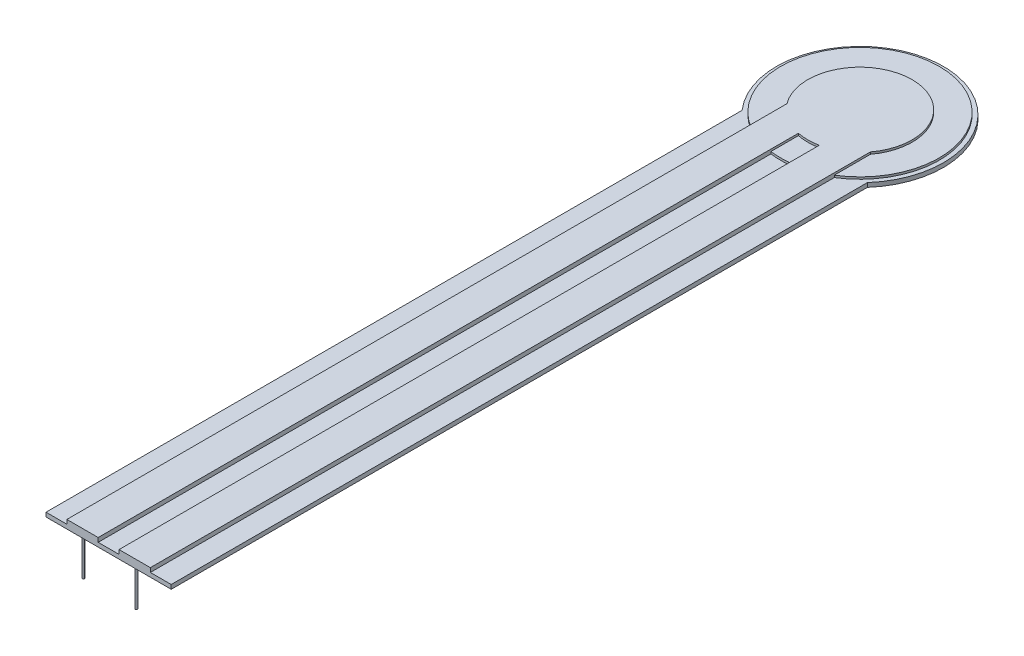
ISO-10303-21;
HEADER;
FILE_DESCRIPTION(('STEP AP214'),'2;1');
FILE_NAME('part.step','',(''),(''),'','','');
FILE_SCHEMA(('AUTOMOTIVE_DESIGN { 1 0 10303 214 1 1 1 1 }'));
ENDSEC;
DATA;
#1=APPLICATION_CONTEXT('core data for automotive mechanical design processes');
#2=APPLICATION_PROTOCOL_DEFINITION('international standard','automotive_design',2000,#1);
#3=PRODUCT_CONTEXT('',#1,'mechanical');
#4=PRODUCT('Part','Part','',(#3));
#5=PRODUCT_RELATED_PRODUCT_CATEGORY('part','',(#4));
#6=PRODUCT_DEFINITION_FORMATION('','',#4);
#7=PRODUCT_DEFINITION_CONTEXT('part definition',#1,'design');
#8=PRODUCT_DEFINITION('design','',#6,#7);
#9=PRODUCT_DEFINITION_SHAPE('','',#8);
#10=(LENGTH_UNIT() NAMED_UNIT(*) SI_UNIT(.MILLI.,.METRE.));
#11=(NAMED_UNIT(*) PLANE_ANGLE_UNIT() SI_UNIT($,.RADIAN.));
#12=(NAMED_UNIT(*) SI_UNIT($,.STERADIAN.) SOLID_ANGLE_UNIT());
#13=UNCERTAINTY_MEASURE_WITH_UNIT(LENGTH_MEASURE(1.E-05),#10,'distance_accuracy_value','');
#14=(GEOMETRIC_REPRESENTATION_CONTEXT(3) GLOBAL_UNCERTAINTY_ASSIGNED_CONTEXT((#13)) GLOBAL_UNIT_ASSIGNED_CONTEXT((#10,
#11,#12)) REPRESENTATION_CONTEXT('',''));
#15=CARTESIAN_POINT('',(0.,0.,0.));
#16=DIRECTION('',(0.,0.,1.));
#17=DIRECTION('',(1.,0.,0.));
#18=AXIS2_PLACEMENT_3D('',#15,#16,#17);
#19=CARTESIAN_POINT('',(0.,0.,-36.));
#20=DIRECTION('',(0.,1.,0.));
#21=DIRECTION('',(0.,0.,1.));
#22=AXIS2_PLACEMENT_3D('',#19,#20,#21);
#23=PLANE('',#22);
#24=CARTESIAN_POINT('',(1.27,0.,-0.057768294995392));
#25=DIRECTION('',(0.,1.,0.));
#26=DIRECTION('',(0.,0.,1.));
#27=AXIS2_PLACEMENT_3D('',#24,#25,#26);
#28=CIRCLE('',#27,0.0499999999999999);
#29=CARTESIAN_POINT('',(1.27,0.,-0.00776829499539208));
#30=VERTEX_POINT('',#29);
#31=EDGE_CURVE('E41',#30,#30,#28,.F.);
#32=ORIENTED_EDGE('',*,*,#31,.F.);
#33=EDGE_LOOP('',(#32));
#34=FACE_BOUND('',#33,.T.);
#35=CARTESIAN_POINT('',(0.,0.,-36.));
#36=DIRECTION('',(0.,1.,0.));
#37=DIRECTION('',(0.,0.,1.));
#38=AXIS2_PLACEMENT_3D('',#35,#36,#37);
#39=CIRCLE('',#38,4.);
#40=CARTESIAN_POINT('',(3.,0.,-33.3542486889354));
#41=VERTEX_POINT('',#40);
#42=CARTESIAN_POINT('',(-3.,0.,-33.3542486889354));
#43=VERTEX_POINT('',#42);
#44=EDGE_CURVE('E194',#41,#43,#39,.T.);
#45=ORIENTED_EDGE('',*,*,#44,.F.);
#46=DIRECTION('',(0.,0.,-1.));
#47=VECTOR('',#46,1.);
#48=CARTESIAN_POINT('',(3.,0.,0.));
#49=LINE('',#48,#47);
#50=CARTESIAN_POINT('',(3.,0.,0.));
#51=VERTEX_POINT('',#50);
#52=EDGE_CURVE('E186',#51,#41,#49,.T.);
#53=ORIENTED_EDGE('',*,*,#52,.F.);
#54=DIRECTION('',(1.,0.,0.));
#55=VECTOR('',#54,1.);
#56=CARTESIAN_POINT('',(-2.99999999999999,0.,0.));
#57=LINE('',#56,#55);
#58=CARTESIAN_POINT('',(-2.99999999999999,0.,0.));
#59=VERTEX_POINT('',#58);
#60=EDGE_CURVE('E190',#59,#51,#57,.T.);
#61=ORIENTED_EDGE('',*,*,#60,.F.);
#62=DIRECTION('',(0.,0.,1.));
#63=VECTOR('',#62,1.);
#64=CARTESIAN_POINT('',(-2.99999999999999,0.,0.));
#65=LINE('',#64,#63);
#66=EDGE_CURVE('E192',#43,#59,#65,.T.);
#67=ORIENTED_EDGE('',*,*,#66,.F.);
#68=EDGE_LOOP('',(#45,#53,#61,#67));
#69=FACE_BOUND('',#68,.T.);
#70=CARTESIAN_POINT('',(-1.27,0.,-0.057768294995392));
#71=DIRECTION('',(0.,1.,0.));
#72=DIRECTION('',(0.,0.,1.));
#73=AXIS2_PLACEMENT_3D('',#70,#71,#72);
#74=CIRCLE('',#73,0.0499999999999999);
#75=CARTESIAN_POINT('',(-1.27,0.,-0.00776829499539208));
#76=VERTEX_POINT('',#75);
#77=EDGE_CURVE('E11',#76,#76,#74,.F.);
#78=ORIENTED_EDGE('',*,*,#77,.F.);
#79=EDGE_LOOP('',(#78));
#80=FACE_BOUND('',#79,.T.);
#81=ADVANCED_FACE('F33',(#34,#69,#80),#23,.F.);
#82=CARTESIAN_POINT('',(0.,0.2,-36.));
#83=DIRECTION('',(0.,1.,0.));
#84=DIRECTION('',(0.,0.,1.));
#85=AXIS2_PLACEMENT_3D('',#82,#83,#84);
#86=PLANE('',#85);
#87=DIRECTION('',(1.,0.,0.));
#88=VECTOR('',#87,1.);
#89=CARTESIAN_POINT('',(-2.99999999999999,0.2,0.));
#90=LINE('',#89,#88);
#91=CARTESIAN_POINT('',(-2.99999999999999,0.2,0.));
#92=VERTEX_POINT('',#91);
#93=CARTESIAN_POINT('',(-2.,0.2,0.));
#94=VERTEX_POINT('',#93);
#95=EDGE_CURVE('E165',#92,#94,#90,.T.);
#96=ORIENTED_EDGE('',*,*,#95,.T.);
#97=DIRECTION('',(0.,0.,1.));
#98=VECTOR('',#97,1.);
#99=CARTESIAN_POINT('',(-2.,0.2,0.));
#100=LINE('',#99,#98);
#101=CARTESIAN_POINT('',(-2.,0.2,-32.7689011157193));
#102=VERTEX_POINT('',#101);
#103=EDGE_CURVE('E148',#102,#94,#100,.T.);
#104=ORIENTED_EDGE('',*,*,#103,.F.);
#105=CARTESIAN_POINT('',(0.,0.2,-36.));
#106=DIRECTION('',(0.,1.,0.));
#107=DIRECTION('',(0.,0.,1.));
#108=AXIS2_PLACEMENT_3D('',#105,#106,#107);
#109=CIRCLE('',#108,3.8);
#110=CARTESIAN_POINT('',(2.,0.2,-32.7689011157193));
#111=VERTEX_POINT('',#110);
#112=EDGE_CURVE('E201',#111,#102,#109,.T.);
#113=ORIENTED_EDGE('',*,*,#112,.F.);
#114=DIRECTION('',(0.,0.,-1.));
#115=VECTOR('',#114,1.);
#116=CARTESIAN_POINT('',(2.,0.2,0.));
#117=LINE('',#116,#115);
#118=CARTESIAN_POINT('',(2.,0.2,0.));
#119=VERTEX_POINT('',#118);
#120=EDGE_CURVE('E242',#119,#111,#117,.T.);
#121=ORIENTED_EDGE('',*,*,#120,.F.);
#122=CARTESIAN_POINT('',(3.,0.2,0.));
#123=VERTEX_POINT('',#122);
#124=EDGE_CURVE('E177',#119,#123,#90,.T.);
#125=ORIENTED_EDGE('',*,*,#124,.T.);
#126=DIRECTION('',(0.,0.,-1.));
#127=VECTOR('',#126,1.);
#128=CARTESIAN_POINT('',(3.,0.2,0.));
#129=LINE('',#128,#127);
#130=CARTESIAN_POINT('',(3.,0.2,-33.3542486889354));
#131=VERTEX_POINT('',#130);
#132=EDGE_CURVE('E56',#123,#131,#129,.T.);
#133=ORIENTED_EDGE('',*,*,#132,.T.);
#134=CARTESIAN_POINT('',(0.,0.2,-36.));
#135=DIRECTION('',(0.,1.,0.));
#136=DIRECTION('',(0.,0.,1.));
#137=AXIS2_PLACEMENT_3D('',#134,#135,#136);
#138=CIRCLE('',#137,4.);
#139=CARTESIAN_POINT('',(-3.,0.2,-33.3542486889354));
#140=VERTEX_POINT('',#139);
#141=EDGE_CURVE('E185',#131,#140,#138,.T.);
#142=ORIENTED_EDGE('',*,*,#141,.T.);
#143=DIRECTION('',(0.,0.,1.));
#144=VECTOR('',#143,1.);
#145=CARTESIAN_POINT('',(-2.99999999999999,0.2,0.));
#146=LINE('',#145,#144);
#147=EDGE_CURVE('E173',#140,#92,#146,.T.);
#148=ORIENTED_EDGE('',*,*,#147,.T.);
#149=EDGE_LOOP('',(#96,#104,#113,#121,#125,#133,#142,#148));
#150=FACE_BOUND('',#149,.T.);
#151=ADVANCED_FACE('F172',(#150),#86,.T.);
#152=CARTESIAN_POINT('',(-0.5,0.2,-32.2330383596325));
#153=VERTEX_POINT('',#152);
#154=CARTESIAN_POINT('',(0.5,0.2,-32.2330383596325));
#155=VERTEX_POINT('',#154);
#156=EDGE_CURVE('E202',#153,#155,#109,.T.);
#157=ORIENTED_EDGE('',*,*,#156,.F.);
#158=DIRECTION('',(0.,0.,-1.));
#159=VECTOR('',#158,1.);
#160=CARTESIAN_POINT('',(-0.5,0.2,0.));
#161=LINE('',#160,#159);
#162=CARTESIAN_POINT('',(-0.5,0.2,0.));
#163=VERTEX_POINT('',#162);
#164=EDGE_CURVE('E158',#163,#153,#161,.T.);
#165=ORIENTED_EDGE('',*,*,#164,.F.);
#166=CARTESIAN_POINT('',(0.5,0.2,0.));
#167=VERTEX_POINT('',#166);
#168=EDGE_CURVE('E175',#163,#167,#90,.T.);
#169=ORIENTED_EDGE('',*,*,#168,.T.);
#170=DIRECTION('',(0.,0.,1.));
#171=VECTOR('',#170,1.);
#172=CARTESIAN_POINT('',(0.5,0.2,0.));
#173=LINE('',#172,#171);
#174=EDGE_CURVE('E244',#155,#167,#173,.T.);
#175=ORIENTED_EDGE('',*,*,#174,.F.);
#176=EDGE_LOOP('',(#157,#165,#169,#175));
#177=FACE_BOUND('',#176,.T.);
#178=ADVANCED_FACE('F268',(#177),#86,.T.);
#179=CARTESIAN_POINT('',(0.,0.3,-36.));
#180=DIRECTION('',(0.,-1.,0.));
#181=DIRECTION('',(0.,0.,-1.));
#182=AXIS2_PLACEMENT_3D('',#179,#180,#181);
#183=CYLINDRICAL_SURFACE('',#182,3.8);
#184=DIRECTION('',(0.,-1.,0.));
#185=VECTOR('',#184,1.);
#186=CARTESIAN_POINT('',(-2.,0.3,-32.7689011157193));
#187=LINE('',#186,#185);
#188=CARTESIAN_POINT('',(-2.,0.3,-32.7689011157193));
#189=VERTEX_POINT('',#188);
#190=EDGE_CURVE('E154',#189,#102,#187,.T.);
#191=ORIENTED_EDGE('',*,*,#190,.F.);
#192=CARTESIAN_POINT('',(0.,0.3,-36.));
#193=DIRECTION('',(0.,1.,0.));
#194=DIRECTION('',(0.,0.,1.));
#195=AXIS2_PLACEMENT_3D('',#192,#193,#194);
#196=CIRCLE('',#195,3.8);
#197=CARTESIAN_POINT('',(2.,0.3,-32.7689011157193));
#198=VERTEX_POINT('',#197);
#199=EDGE_CURVE('E197',#198,#189,#196,.T.);
#200=ORIENTED_EDGE('',*,*,#199,.F.);
#201=DIRECTION('',(0.,-1.,0.));
#202=VECTOR('',#201,1.);
#203=CARTESIAN_POINT('',(2.,0.3,-32.7689011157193));
#204=LINE('',#203,#202);
#205=EDGE_CURVE('E169',#111,#198,#204,.F.);
#206=ORIENTED_EDGE('',*,*,#205,.F.);
#207=ORIENTED_EDGE('',*,*,#112,.T.);
#208=EDGE_LOOP('',(#191,#200,#206,#207));
#209=FACE_BOUND('',#208,.T.);
#210=ADVANCED_FACE('F273',(#209),#183,.T.);
#211=DIRECTION('',(0.,-1.,0.));
#212=VECTOR('',#211,1.);
#213=CARTESIAN_POINT('',(-0.5,0.3,-32.2330383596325));
#214=LINE('',#213,#212);
#215=CARTESIAN_POINT('',(-0.5,0.3,-32.2330383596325));
#216=VERTEX_POINT('',#215);
#217=EDGE_CURVE('E206',#153,#216,#214,.F.);
#218=ORIENTED_EDGE('',*,*,#217,.F.);
#219=ORIENTED_EDGE('',*,*,#156,.T.);
#220=DIRECTION('',(0.,-1.,0.));
#221=VECTOR('',#220,1.);
#222=CARTESIAN_POINT('',(0.5,0.3,-32.2330383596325));
#223=LINE('',#222,#221);
#224=CARTESIAN_POINT('',(0.5,0.3,-32.2330383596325));
#225=VERTEX_POINT('',#224);
#226=EDGE_CURVE('E208',#225,#155,#223,.T.);
#227=ORIENTED_EDGE('',*,*,#226,.F.);
#228=EDGE_CURVE('E198',#216,#225,#196,.T.);
#229=ORIENTED_EDGE('',*,*,#228,.F.);
#230=EDGE_LOOP('',(#218,#219,#227,#229));
#231=FACE_BOUND('',#230,.T.);
#232=ADVANCED_FACE('F361',(#231),#183,.T.);
#233=CARTESIAN_POINT('',(0.,0.3,-36.));
#234=DIRECTION('',(0.,1.,0.));
#235=DIRECTION('',(0.,0.,1.));
#236=AXIS2_PLACEMENT_3D('',#233,#234,#235);
#237=PLANE('',#236);
#238=CARTESIAN_POINT('',(0.,0.3,-36.));
#239=DIRECTION('',(0.,1.,0.));
#240=DIRECTION('',(0.,0.,1.));
#241=AXIS2_PLACEMENT_3D('',#238,#239,#240);
#242=CIRCLE('',#241,2.5);
#243=CARTESIAN_POINT('',(0.500000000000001,0.3,-33.5505102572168));
#244=VERTEX_POINT('',#243);
#245=CARTESIAN_POINT('',(-0.5,0.3,-33.5505102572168));
#246=VERTEX_POINT('',#245);
#247=EDGE_CURVE('E317',#244,#246,#242,.F.);
#248=ORIENTED_EDGE('',*,*,#247,.T.);
#249=DIRECTION('',(0.,0.,1.));
#250=VECTOR('',#249,1.);
#251=CARTESIAN_POINT('',(-0.5,0.3,-36.));
#252=LINE('',#251,#250);
#253=EDGE_CURVE('E320',#246,#216,#252,.T.);
#254=ORIENTED_EDGE('',*,*,#253,.T.);
#255=ORIENTED_EDGE('',*,*,#228,.T.);
#256=DIRECTION('',(0.,0.,-1.));
#257=VECTOR('',#256,1.);
#258=CARTESIAN_POINT('',(0.5,0.3,-36.));
#259=LINE('',#258,#257);
#260=EDGE_CURVE('E314',#225,#244,#259,.T.);
#261=ORIENTED_EDGE('',*,*,#260,.T.);
#262=EDGE_LOOP('',(#248,#254,#255,#261));
#263=FACE_BOUND('',#262,.T.);
#264=ADVANCED_FACE('F359',(#263),#237,.T.);
#265=ORIENTED_EDGE('',*,*,#199,.T.);
#266=DIRECTION('',(0.,0.,-1.));
#267=VECTOR('',#266,1.);
#268=CARTESIAN_POINT('',(-2.,0.3,-36.));
#269=LINE('',#268,#267);
#270=CARTESIAN_POINT('',(-2.,0.3,-34.5));
#271=VERTEX_POINT('',#270);
#272=EDGE_CURVE('E311',#189,#271,#269,.T.);
#273=ORIENTED_EDGE('',*,*,#272,.T.);
#274=CARTESIAN_POINT('',(0.,0.3,-36.));
#275=DIRECTION('',(0.,1.,0.));
#276=DIRECTION('',(0.,0.,1.));
#277=AXIS2_PLACEMENT_3D('',#274,#275,#276);
#278=CIRCLE('',#277,2.5);
#279=CARTESIAN_POINT('',(2.,0.3,-34.5));
#280=VERTEX_POINT('',#279);
#281=EDGE_CURVE('E305',#271,#280,#278,.F.);
#282=ORIENTED_EDGE('',*,*,#281,.T.);
#283=DIRECTION('',(0.,0.,1.));
#284=VECTOR('',#283,1.);
#285=CARTESIAN_POINT('',(2.,0.3,-36.));
#286=LINE('',#285,#284);
#287=EDGE_CURVE('E308',#280,#198,#286,.T.);
#288=ORIENTED_EDGE('',*,*,#287,.T.);
#289=EDGE_LOOP('',(#265,#273,#282,#288));
#290=FACE_BOUND('',#289,.T.);
#291=ADVANCED_FACE('F287',(#290),#237,.T.);
#292=CARTESIAN_POINT('',(0.,0.2,-36.));
#293=DIRECTION('',(0.,-1.,0.));
#294=DIRECTION('',(0.,0.,-1.));
#295=AXIS2_PLACEMENT_3D('',#292,#293,#294);
#296=CYLINDRICAL_SURFACE('',#295,4.);
#297=ORIENTED_EDGE('',*,*,#44,.T.);
#298=DIRECTION('',(0.,-1.,0.));
#299=VECTOR('',#298,1.);
#300=CARTESIAN_POINT('',(-3.,0.2,-33.3542486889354));
#301=LINE('',#300,#299);
#302=EDGE_CURVE('E292',#140,#43,#301,.T.);
#303=ORIENTED_EDGE('',*,*,#302,.F.);
#304=ORIENTED_EDGE('',*,*,#141,.F.);
#305=DIRECTION('',(0.,-1.,0.));
#306=VECTOR('',#305,1.);
#307=CARTESIAN_POINT('',(3.,0.2,-33.3542486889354));
#308=LINE('',#307,#306);
#309=EDGE_CURVE('E178',#131,#41,#308,.T.);
#310=ORIENTED_EDGE('',*,*,#309,.T.);
#311=EDGE_LOOP('',(#297,#303,#304,#310));
#312=FACE_BOUND('',#311,.T.);
#313=ADVANCED_FACE('F35',(#312),#296,.T.);
#314=CARTESIAN_POINT('',(-2.99999999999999,0.2,0.));
#315=DIRECTION('',(1.,0.,0.));
#316=DIRECTION('',(0.,0.,-1.));
#317=AXIS2_PLACEMENT_3D('',#314,#315,#316);
#318=PLANE('',#317);
#319=ORIENTED_EDGE('',*,*,#66,.T.);
#320=DIRECTION('',(0.,-1.,0.));
#321=VECTOR('',#320,1.);
#322=CARTESIAN_POINT('',(-2.99999999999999,0.2,0.));
#323=LINE('',#322,#321);
#324=EDGE_CURVE('E290',#92,#59,#323,.T.);
#325=ORIENTED_EDGE('',*,*,#324,.F.);
#326=ORIENTED_EDGE('',*,*,#147,.F.);
#327=ORIENTED_EDGE('',*,*,#302,.T.);
#328=EDGE_LOOP('',(#319,#325,#326,#327));
#329=FACE_BOUND('',#328,.T.);
#330=ADVANCED_FACE('F281',(#329),#318,.F.);
#331=CARTESIAN_POINT('',(-2.99999999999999,0.2,0.));
#332=DIRECTION('',(0.,0.,-1.));
#333=DIRECTION('',(-1.,0.,0.));
#334=AXIS2_PLACEMENT_3D('',#331,#332,#333);
#335=PLANE('',#334);
#336=ORIENTED_EDGE('',*,*,#60,.T.);
#337=DIRECTION('',(0.,-1.,0.));
#338=VECTOR('',#337,1.);
#339=CARTESIAN_POINT('',(3.,0.2,0.));
#340=LINE('',#339,#338);
#341=EDGE_CURVE('E296',#123,#51,#340,.T.);
#342=ORIENTED_EDGE('',*,*,#341,.F.);
#343=ORIENTED_EDGE('',*,*,#124,.F.);
#344=DIRECTION('',(0.,-1.,0.));
#345=VECTOR('',#344,1.);
#346=CARTESIAN_POINT('',(2.,0.4,0.));
#347=LINE('',#346,#345);
#348=CARTESIAN_POINT('',(2.,0.4,0.));
#349=VERTEX_POINT('',#348);
#350=EDGE_CURVE('E221',#349,#119,#347,.T.);
#351=ORIENTED_EDGE('',*,*,#350,.F.);
#352=DIRECTION('',(1.,0.,0.));
#353=VECTOR('',#352,1.);
#354=CARTESIAN_POINT('',(2.,0.4,0.));
#355=LINE('',#354,#353);
#356=CARTESIAN_POINT('',(0.5,0.4,0.));
#357=VERTEX_POINT('',#356);
#358=EDGE_CURVE('E231',#357,#349,#355,.T.);
#359=ORIENTED_EDGE('',*,*,#358,.F.);
#360=DIRECTION('',(0.,-1.,0.));
#361=VECTOR('',#360,1.);
#362=CARTESIAN_POINT('',(0.5,0.4,0.));
#363=LINE('',#362,#361);
#364=EDGE_CURVE('E218',#357,#167,#363,.T.);
#365=ORIENTED_EDGE('',*,*,#364,.T.);
#366=ORIENTED_EDGE('',*,*,#168,.F.);
#367=DIRECTION('',(0.,-1.,0.));
#368=VECTOR('',#367,1.);
#369=CARTESIAN_POINT('',(-0.5,0.4,0.));
#370=LINE('',#369,#368);
#371=CARTESIAN_POINT('',(-0.5,0.4,0.));
#372=VERTEX_POINT('',#371);
#373=EDGE_CURVE('E170',#372,#163,#370,.T.);
#374=ORIENTED_EDGE('',*,*,#373,.F.);
#375=DIRECTION('',(1.,0.,0.));
#376=VECTOR('',#375,1.);
#377=CARTESIAN_POINT('',(-2.,0.4,0.));
#378=LINE('',#377,#376);
#379=CARTESIAN_POINT('',(-2.,0.4,0.));
#380=VERTEX_POINT('',#379);
#381=EDGE_CURVE('E167',#380,#372,#378,.T.);
#382=ORIENTED_EDGE('',*,*,#381,.F.);
#383=DIRECTION('',(0.,-1.,0.));
#384=VECTOR('',#383,1.);
#385=CARTESIAN_POINT('',(-2.,0.4,0.));
#386=LINE('',#385,#384);
#387=EDGE_CURVE('E152',#380,#94,#386,.T.);
#388=ORIENTED_EDGE('',*,*,#387,.T.);
#389=ORIENTED_EDGE('',*,*,#95,.F.);
#390=ORIENTED_EDGE('',*,*,#324,.T.);
#391=EDGE_LOOP('',(#336,#342,#343,#351,#359,#365,#366,#374,#382,#388,#389,#390));
#392=FACE_BOUND('',#391,.T.);
#393=ADVANCED_FACE('F163',(#392),#335,.F.);
#394=CARTESIAN_POINT('',(3.,0.2,0.));
#395=DIRECTION('',(-1.,0.,0.));
#396=DIRECTION('',(0.,0.,1.));
#397=AXIS2_PLACEMENT_3D('',#394,#395,#396);
#398=PLANE('',#397);
#399=ORIENTED_EDGE('',*,*,#52,.T.);
#400=ORIENTED_EDGE('',*,*,#309,.F.);
#401=ORIENTED_EDGE('',*,*,#132,.F.);
#402=ORIENTED_EDGE('',*,*,#341,.T.);
#403=EDGE_LOOP('',(#399,#400,#401,#402));
#404=FACE_BOUND('',#403,.T.);
#405=ADVANCED_FACE('F276',(#404),#398,.F.);
#406=CARTESIAN_POINT('',(-2.,0.4,0.));
#407=DIRECTION('',(1.,0.,0.));
#408=DIRECTION('',(0.,0.,-1.));
#409=AXIS2_PLACEMENT_3D('',#406,#407,#408);
#410=PLANE('',#409);
#411=ORIENTED_EDGE('',*,*,#272,.F.);
#412=ORIENTED_EDGE('',*,*,#190,.T.);
#413=ORIENTED_EDGE('',*,*,#103,.T.);
#414=ORIENTED_EDGE('',*,*,#387,.F.);
#415=DIRECTION('',(0.,0.,1.));
#416=VECTOR('',#415,1.);
#417=CARTESIAN_POINT('',(-2.,0.4,0.));
#418=LINE('',#417,#416);
#419=CARTESIAN_POINT('',(-2.,0.4,-34.5));
#420=VERTEX_POINT('',#419);
#421=EDGE_CURVE('E240',#420,#380,#418,.T.);
#422=ORIENTED_EDGE('',*,*,#421,.F.);
#423=DIRECTION('',(0.,-1.,0.));
#424=VECTOR('',#423,1.);
#425=CARTESIAN_POINT('',(-2.,0.4,-34.5));
#426=LINE('',#425,#424);
#427=EDGE_CURVE('E224',#420,#271,#426,.T.);
#428=ORIENTED_EDGE('',*,*,#427,.T.);
#429=EDGE_LOOP('',(#411,#412,#413,#414,#422,#428));
#430=FACE_BOUND('',#429,.T.);
#431=ADVANCED_FACE('F150',(#430),#410,.F.);
#432=CARTESIAN_POINT('',(-0.5,0.4,0.));
#433=DIRECTION('',(-1.,0.,0.));
#434=DIRECTION('',(0.,0.,1.));
#435=AXIS2_PLACEMENT_3D('',#432,#433,#434);
#436=PLANE('',#435);
#437=ORIENTED_EDGE('',*,*,#164,.T.);
#438=ORIENTED_EDGE('',*,*,#217,.T.);
#439=ORIENTED_EDGE('',*,*,#253,.F.);
#440=DIRECTION('',(0.,-1.,0.));
#441=VECTOR('',#440,1.);
#442=CARTESIAN_POINT('',(-0.5,0.4,-33.5505102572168));
#443=LINE('',#442,#441);
#444=CARTESIAN_POINT('',(-0.5,0.4,-33.5505102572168));
#445=VERTEX_POINT('',#444);
#446=EDGE_CURVE('E212',#445,#246,#443,.T.);
#447=ORIENTED_EDGE('',*,*,#446,.F.);
#448=DIRECTION('',(0.,0.,-1.));
#449=VECTOR('',#448,1.);
#450=CARTESIAN_POINT('',(-0.5,0.4,0.));
#451=LINE('',#450,#449);
#452=EDGE_CURVE('E237',#372,#445,#451,.T.);
#453=ORIENTED_EDGE('',*,*,#452,.F.);
#454=ORIENTED_EDGE('',*,*,#373,.T.);
#455=EDGE_LOOP('',(#437,#438,#439,#447,#453,#454));
#456=FACE_BOUND('',#455,.T.);
#457=ADVANCED_FACE('F350',(#456),#436,.F.);
#458=CARTESIAN_POINT('',(0.5,0.4,0.));
#459=DIRECTION('',(1.,0.,0.));
#460=DIRECTION('',(0.,0.,-1.));
#461=AXIS2_PLACEMENT_3D('',#458,#459,#460);
#462=PLANE('',#461);
#463=ORIENTED_EDGE('',*,*,#260,.F.);
#464=ORIENTED_EDGE('',*,*,#226,.T.);
#465=ORIENTED_EDGE('',*,*,#174,.T.);
#466=ORIENTED_EDGE('',*,*,#364,.F.);
#467=DIRECTION('',(0.,0.,1.));
#468=VECTOR('',#467,1.);
#469=CARTESIAN_POINT('',(0.5,0.4,0.));
#470=LINE('',#469,#468);
#471=CARTESIAN_POINT('',(0.500000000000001,0.4,-33.5505102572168));
#472=VERTEX_POINT('',#471);
#473=EDGE_CURVE('E233',#472,#357,#470,.T.);
#474=ORIENTED_EDGE('',*,*,#473,.F.);
#475=DIRECTION('',(0.,-1.,0.));
#476=VECTOR('',#475,1.);
#477=CARTESIAN_POINT('',(0.500000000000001,0.4,-33.5505102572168));
#478=LINE('',#477,#476);
#479=EDGE_CURVE('E215',#472,#244,#478,.T.);
#480=ORIENTED_EDGE('',*,*,#479,.T.);
#481=EDGE_LOOP('',(#463,#464,#465,#466,#474,#480));
#482=FACE_BOUND('',#481,.T.);
#483=ADVANCED_FACE('F346',(#482),#462,.F.);
#484=CARTESIAN_POINT('',(2.,0.4,0.));
#485=DIRECTION('',(-1.,0.,0.));
#486=DIRECTION('',(0.,0.,1.));
#487=AXIS2_PLACEMENT_3D('',#484,#485,#486);
#488=PLANE('',#487);
#489=ORIENTED_EDGE('',*,*,#120,.T.);
#490=ORIENTED_EDGE('',*,*,#205,.T.);
#491=ORIENTED_EDGE('',*,*,#287,.F.);
#492=DIRECTION('',(0.,-1.,0.));
#493=VECTOR('',#492,1.);
#494=CARTESIAN_POINT('',(2.,0.4,-34.5));
#495=LINE('',#494,#493);
#496=CARTESIAN_POINT('',(2.,0.4,-34.5));
#497=VERTEX_POINT('',#496);
#498=EDGE_CURVE('E48',#497,#280,#495,.T.);
#499=ORIENTED_EDGE('',*,*,#498,.F.);
#500=DIRECTION('',(0.,0.,-1.));
#501=VECTOR('',#500,1.);
#502=CARTESIAN_POINT('',(2.,0.4,0.));
#503=LINE('',#502,#501);
#504=EDGE_CURVE('E229',#349,#497,#503,.T.);
#505=ORIENTED_EDGE('',*,*,#504,.F.);
#506=ORIENTED_EDGE('',*,*,#350,.T.);
#507=EDGE_LOOP('',(#489,#490,#491,#499,#505,#506));
#508=FACE_BOUND('',#507,.T.);
#509=ADVANCED_FACE('F343',(#508),#488,.F.);
#510=CARTESIAN_POINT('',(0.,0.4,-36.));
#511=DIRECTION('',(0.,-1.,0.));
#512=DIRECTION('',(0.,0.,-1.));
#513=AXIS2_PLACEMENT_3D('',#510,#511,#512);
#514=CYLINDRICAL_SURFACE('',#513,2.5);
#515=ORIENTED_EDGE('',*,*,#247,.F.);
#516=ORIENTED_EDGE('',*,*,#479,.F.);
#517=CARTESIAN_POINT('',(0.,0.4,-36.));
#518=DIRECTION('',(0.,1.,0.));
#519=DIRECTION('',(0.,0.,1.));
#520=AXIS2_PLACEMENT_3D('',#517,#518,#519);
#521=CIRCLE('',#520,2.5);
#522=EDGE_CURVE('E235',#445,#472,#521,.T.);
#523=ORIENTED_EDGE('',*,*,#522,.F.);
#524=ORIENTED_EDGE('',*,*,#446,.T.);
#525=EDGE_LOOP('',(#515,#516,#523,#524));
#526=FACE_BOUND('',#525,.T.);
#527=ADVANCED_FACE('F342',(#526),#514,.T.);
#528=CARTESIAN_POINT('',(0.,0.4,-36.));
#529=DIRECTION('',(0.,-1.,0.));
#530=DIRECTION('',(0.,0.,-1.));
#531=AXIS2_PLACEMENT_3D('',#528,#529,#530);
#532=CYLINDRICAL_SURFACE('',#531,2.5);
#533=ORIENTED_EDGE('',*,*,#281,.F.);
#534=ORIENTED_EDGE('',*,*,#427,.F.);
#535=CARTESIAN_POINT('',(0.,0.4,-36.));
#536=DIRECTION('',(0.,1.,0.));
#537=DIRECTION('',(0.,0.,1.));
#538=AXIS2_PLACEMENT_3D('',#535,#536,#537);
#539=CIRCLE('',#538,2.5);
#540=EDGE_CURVE('E227',#497,#420,#539,.T.);
#541=ORIENTED_EDGE('',*,*,#540,.F.);
#542=ORIENTED_EDGE('',*,*,#498,.T.);
#543=EDGE_LOOP('',(#533,#534,#541,#542));
#544=FACE_BOUND('',#543,.T.);
#545=ADVANCED_FACE('F335',(#544),#532,.T.);
#546=CARTESIAN_POINT('',(0.,0.4,-36.));
#547=DIRECTION('',(0.,1.,0.));
#548=DIRECTION('',(0.,0.,1.));
#549=AXIS2_PLACEMENT_3D('',#546,#547,#548);
#550=PLANE('',#549);
#551=ORIENTED_EDGE('',*,*,#421,.T.);
#552=ORIENTED_EDGE('',*,*,#381,.T.);
#553=ORIENTED_EDGE('',*,*,#452,.T.);
#554=ORIENTED_EDGE('',*,*,#522,.T.);
#555=ORIENTED_EDGE('',*,*,#473,.T.);
#556=ORIENTED_EDGE('',*,*,#358,.T.);
#557=ORIENTED_EDGE('',*,*,#504,.T.);
#558=ORIENTED_EDGE('',*,*,#540,.T.);
#559=EDGE_LOOP('',(#551,#552,#553,#554,#555,#556,#557,#558));
#560=FACE_BOUND('',#559,.T.);
#561=ADVANCED_FACE('F326',(#560),#550,.T.);
#562=CARTESIAN_POINT('',(1.27,-1.7,-0.057768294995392));
#563=DIRECTION('',(0.,1.,0.));
#564=DIRECTION('',(0.,0.,1.));
#565=AXIS2_PLACEMENT_3D('',#562,#563,#564);
#566=CYLINDRICAL_SURFACE('',#565,0.0499999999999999);
#567=CARTESIAN_POINT('',(1.27,-1.7,-0.057768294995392));
#568=DIRECTION('',(0.,-1.,0.));
#569=DIRECTION('',(0.,0.,-1.));
#570=AXIS2_PLACEMENT_3D('',#567,#568,#569);
#571=CIRCLE('',#570,0.0499999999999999);
#572=CARTESIAN_POINT('',(1.27,-1.7,-0.107768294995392));
#573=VERTEX_POINT('',#572);
#574=EDGE_CURVE('E159',#573,#573,#571,.T.);
#575=ORIENTED_EDGE('',*,*,#574,.F.);
#576=EDGE_LOOP('',(#575));
#577=FACE_BOUND('',#576,.T.);
#578=ORIENTED_EDGE('',*,*,#31,.T.);
#579=EDGE_LOOP('',(#578));
#580=FACE_BOUND('',#579,.T.);
#581=ADVANCED_FACE('F324',(#577,#580),#566,.T.);
#582=CARTESIAN_POINT('',(1.27,-1.7,-0.057768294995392));
#583=DIRECTION('',(0.,-1.,0.));
#584=DIRECTION('',(0.,0.,-1.));
#585=AXIS2_PLACEMENT_3D('',#582,#583,#584);
#586=PLANE('',#585);
#587=ORIENTED_EDGE('',*,*,#574,.T.);
#588=EDGE_LOOP('',(#587));
#589=FACE_BOUND('',#588,.T.);
#590=ADVANCED_FACE('F258',(#589),#586,.T.);
#591=CARTESIAN_POINT('',(-1.27,-1.7,-0.057768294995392));
#592=DIRECTION('',(0.,1.,0.));
#593=DIRECTION('',(0.,0.,1.));
#594=AXIS2_PLACEMENT_3D('',#591,#592,#593);
#595=CYLINDRICAL_SURFACE('',#594,0.0499999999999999);
#596=CARTESIAN_POINT('',(-1.27,-1.7,-0.057768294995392));
#597=DIRECTION('',(0.,-1.,0.));
#598=DIRECTION('',(0.,0.,1.));
#599=AXIS2_PLACEMENT_3D('',#596,#597,#598);
#600=CIRCLE('',#599,0.0499999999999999);
#601=CARTESIAN_POINT('',(-1.27,-1.7,-0.00776829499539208));
#602=VERTEX_POINT('',#601);
#603=EDGE_CURVE('E249',#602,#602,#600,.T.);
#604=ORIENTED_EDGE('',*,*,#603,.F.);
#605=EDGE_LOOP('',(#604));
#606=FACE_BOUND('',#605,.T.);
#607=ORIENTED_EDGE('',*,*,#77,.T.);
#608=EDGE_LOOP('',(#607));
#609=FACE_BOUND('',#608,.T.);
#610=ADVANCED_FACE('F255',(#606,#609),#595,.T.);
#611=CARTESIAN_POINT('',(-1.27,-1.7,-0.057768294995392));
#612=DIRECTION('',(0.,1.,0.));
#613=DIRECTION('',(0.,0.,1.));
#614=AXIS2_PLACEMENT_3D('',#611,#612,#613);
#615=PLANE('',#614);
#616=ORIENTED_EDGE('',*,*,#603,.T.);
#617=EDGE_LOOP('',(#616));
#618=FACE_BOUND('',#617,.T.);
#619=ADVANCED_FACE('F253',(#618),#615,.F.);
#620=CLOSED_SHELL('',(#81,#151,#178,#210,#232,#264,#291,#313,#330,#393,#405,#431,#457,#483,#509,
#527,#545,#561,#581,#590,#610,#619));
#621=MANIFOLD_SOLID_BREP('B2',#620);
#622=ADVANCED_BREP_SHAPE_REPRESENTATION('',(#18,#621),#14);
#623=SHAPE_DEFINITION_REPRESENTATION(#9,#622);
ENDSEC;
END-ISO-10303-21;
